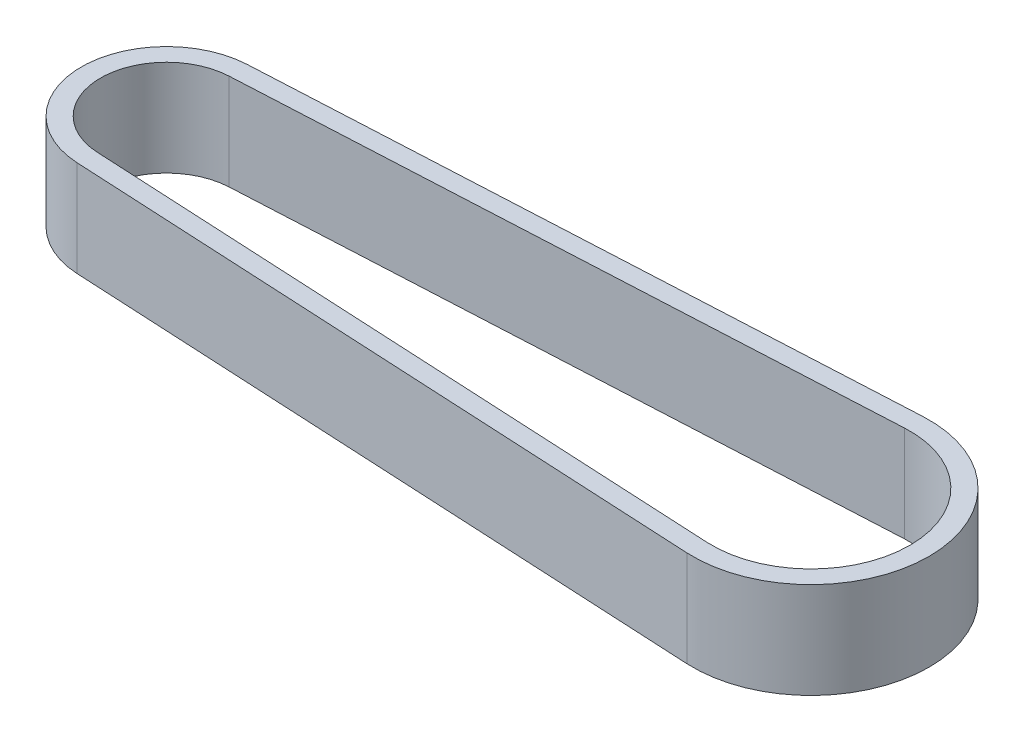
from build123d import *

# Parameters (mm, degrees)
SALIENTE_EXTRUIR1_DEPTH = 10


with BuildPart() as part:
    # Croquis1 → Saliente-Extruir1 (new, symmetric)
    with BuildSketch(Plane(origin=(0, 0, 0), x_dir=(1, 0, 0), z_dir=(0, 1, 0))):
        with BuildLine():
            Line((-68.029052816, 17.72670649), (65.858849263, 24.592684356))
            ThreePointArc((65.858849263, 24.592684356), (91.745, 0), (65.858849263, -24.592684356))
            Line((65.858849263, -24.592684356), (-68.029052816, -17.72670649))
            ThreePointArc((-68.029052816, -17.72670649), (-84.87, 0), (-68.029052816, 17.72670649))
        make_face()
        with BuildLine():
            Line((-67.824195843, 13.731955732), (66.063706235, 20.597933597))
            ThreePointArc((66.063706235, 20.597933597), (87.745, 0), (66.063706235, -20.597933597))
            Line((66.063706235, -20.597933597), (-67.824195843, -13.731955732))
            ThreePointArc((-67.824195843, -13.731955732), (-80.87, 0), (-67.824195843, 13.731955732))
        make_face(mode=Mode.SUBTRACT)
    extrude(amount=SALIENTE_EXTRUIR1_DEPTH, both=True)


solid = part.part
